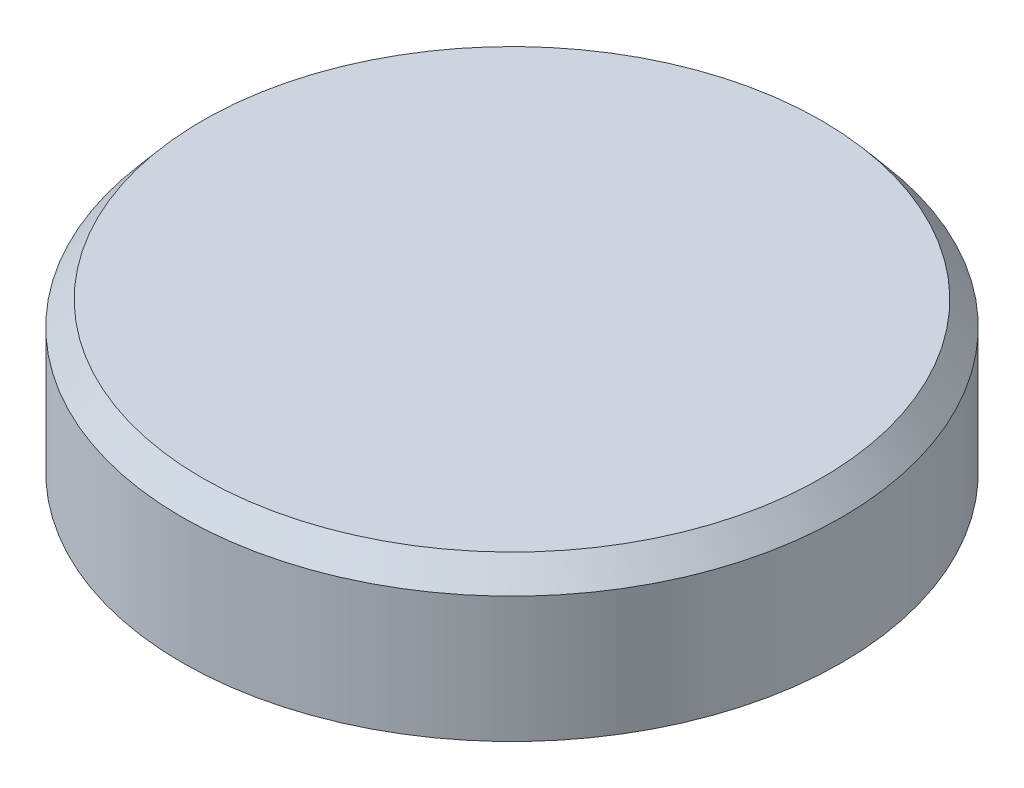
ISO-10303-21;
HEADER;
FILE_DESCRIPTION(('STEP AP214'),'2;1');
FILE_NAME('part.step','',(''),(''),'','','');
FILE_SCHEMA(('AUTOMOTIVE_DESIGN { 1 0 10303 214 1 1 1 1 }'));
ENDSEC;
DATA;
#1=APPLICATION_CONTEXT('core data for automotive mechanical design processes');
#2=APPLICATION_PROTOCOL_DEFINITION('international standard','automotive_design',2000,#1);
#3=PRODUCT_CONTEXT('',#1,'mechanical');
#4=PRODUCT('Part','Part','',(#3));
#5=PRODUCT_RELATED_PRODUCT_CATEGORY('part','',(#4));
#6=PRODUCT_DEFINITION_FORMATION('','',#4);
#7=PRODUCT_DEFINITION_CONTEXT('part definition',#1,'design');
#8=PRODUCT_DEFINITION('design','',#6,#7);
#9=PRODUCT_DEFINITION_SHAPE('','',#8);
#10=(LENGTH_UNIT() NAMED_UNIT(*) SI_UNIT(.MILLI.,.METRE.));
#11=(NAMED_UNIT(*) PLANE_ANGLE_UNIT() SI_UNIT($,.RADIAN.));
#12=(NAMED_UNIT(*) SI_UNIT($,.STERADIAN.) SOLID_ANGLE_UNIT());
#13=UNCERTAINTY_MEASURE_WITH_UNIT(LENGTH_MEASURE(1.E-05),#10,'distance_accuracy_value','');
#14=(GEOMETRIC_REPRESENTATION_CONTEXT(3) GLOBAL_UNCERTAINTY_ASSIGNED_CONTEXT((#13)) GLOBAL_UNIT_ASSIGNED_CONTEXT((#10,
#11,#12)) REPRESENTATION_CONTEXT('',''));
#15=CARTESIAN_POINT('',(0.,0.,0.));
#16=DIRECTION('',(0.,0.,1.));
#17=DIRECTION('',(1.,0.,0.));
#18=AXIS2_PLACEMENT_3D('',#15,#16,#17);
#19=CARTESIAN_POINT('',(0.,-1181.,0.));
#20=DIRECTION('',(0.,-1.,0.));
#21=DIRECTION('',(0.,0.,-1.));
#22=AXIS2_PLACEMENT_3D('',#19,#20,#21);
#23=PLANE('',#22);
#24=CARTESIAN_POINT('',(0.,-1181.,0.));
#25=DIRECTION('',(0.,-1.,0.));
#26=DIRECTION('',(0.,0.,-1.));
#27=AXIS2_PLACEMENT_3D('',#24,#25,#26);
#28=CIRCLE('',#27,335.777798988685);
#29=CARTESIAN_POINT('',(0.,-1181.,-335.777798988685));
#30=VERTEX_POINT('',#29);
#31=EDGE_CURVE('E9',#30,#30,#28,.T.);
#32=ORIENTED_EDGE('',*,*,#31,.T.);
#33=EDGE_LOOP('',(#32));
#34=FACE_BOUND('',#33,.T.);
#35=ADVANCED_FACE('F14',(#34),#23,.T.);
#36=CARTESIAN_POINT('',(0.,-1181.,0.));
#37=DIRECTION('',(0.,1.,0.));
#38=DIRECTION('',(0.,0.,1.));
#39=AXIS2_PLACEMENT_3D('',#36,#37,#38);
#40=CONICAL_SURFACE('',#39,335.777798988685,0.959931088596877);
#41=CARTESIAN_POINT('',(0.,-1031.,0.));
#42=DIRECTION('',(0.,-1.,0.));
#43=DIRECTION('',(0.,0.,-1.));
#44=AXIS2_PLACEMENT_3D('',#41,#42,#43);
#45=CIRCLE('',#44,550.);
#46=CARTESIAN_POINT('',(0.,-1031.,-550.));
#47=VERTEX_POINT('',#46);
#48=EDGE_CURVE('E20',#47,#47,#45,.T.);
#49=ORIENTED_EDGE('',*,*,#48,.T.);
#50=EDGE_LOOP('',(#49));
#51=FACE_BOUND('',#50,.T.);
#52=ORIENTED_EDGE('',*,*,#31,.F.);
#53=EDGE_LOOP('',(#52));
#54=FACE_BOUND('',#53,.T.);
#55=ADVANCED_FACE('F47',(#51,#54),#40,.T.);
#56=CARTESIAN_POINT('',(0.,-1181.,0.));
#57=DIRECTION('',(0.,-1.,0.));
#58=DIRECTION('',(0.,0.,-1.));
#59=AXIS2_PLACEMENT_3D('',#56,#57,#58);
#60=CYLINDRICAL_SURFACE('',#59,550.);
#61=CARTESIAN_POINT('',(0.,-821.,0.));
#62=DIRECTION('',(0.,-1.,0.));
#63=DIRECTION('',(0.,0.,-1.));
#64=AXIS2_PLACEMENT_3D('',#61,#62,#63);
#65=CIRCLE('',#64,550.);
#66=CARTESIAN_POINT('',(0.,-821.,-550.));
#67=VERTEX_POINT('',#66);
#68=EDGE_CURVE('E24',#67,#67,#65,.T.);
#69=ORIENTED_EDGE('',*,*,#68,.T.);
#70=EDGE_LOOP('',(#69));
#71=FACE_BOUND('',#70,.T.);
#72=ORIENTED_EDGE('',*,*,#48,.F.);
#73=EDGE_LOOP('',(#72));
#74=FACE_BOUND('',#73,.T.);
#75=ADVANCED_FACE('F44',(#71,#74),#60,.T.);
#76=CARTESIAN_POINT('',(0.,-821.,0.));
#77=DIRECTION('',(0.,-1.,0.));
#78=DIRECTION('',(0.,0.,-1.));
#79=AXIS2_PLACEMENT_3D('',#76,#77,#78);
#80=CONICAL_SURFACE('',#79,550.,0.698131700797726);
#81=CARTESIAN_POINT('',(0.,-781.,0.));
#82=DIRECTION('',(0.,-1.,0.));
#83=DIRECTION('',(0.,0.,-1.));
#84=AXIS2_PLACEMENT_3D('',#81,#82,#83);
#85=CIRCLE('',#84,516.436014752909);
#86=CARTESIAN_POINT('',(0.,-781.,-516.436014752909));
#87=VERTEX_POINT('',#86);
#88=EDGE_CURVE('E28',#87,#87,#85,.T.);
#89=ORIENTED_EDGE('',*,*,#88,.T.);
#90=EDGE_LOOP('',(#89));
#91=FACE_BOUND('',#90,.T.);
#92=ORIENTED_EDGE('',*,*,#68,.F.);
#93=EDGE_LOOP('',(#92));
#94=FACE_BOUND('',#93,.T.);
#95=ADVANCED_FACE('F34',(#91,#94),#80,.T.);
#96=CARTESIAN_POINT('',(516.436014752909,-781.,0.));
#97=DIRECTION('',(0.,1.,0.));
#98=DIRECTION('',(0.,0.,1.));
#99=AXIS2_PLACEMENT_3D('',#96,#97,#98);
#100=PLANE('',#99);
#101=ORIENTED_EDGE('',*,*,#88,.F.);
#102=EDGE_LOOP('',(#101));
#103=FACE_BOUND('',#102,.T.);
#104=ADVANCED_FACE('F37',(#103),#100,.T.);
#105=CLOSED_SHELL('',(#35,#55,#75,#95,#104));
#106=MANIFOLD_SOLID_BREP('B1',#105);
#107=ADVANCED_BREP_SHAPE_REPRESENTATION('',(#18,#106),#14);
#108=SHAPE_DEFINITION_REPRESENTATION(#9,#107);
ENDSEC;
END-ISO-10303-21;
